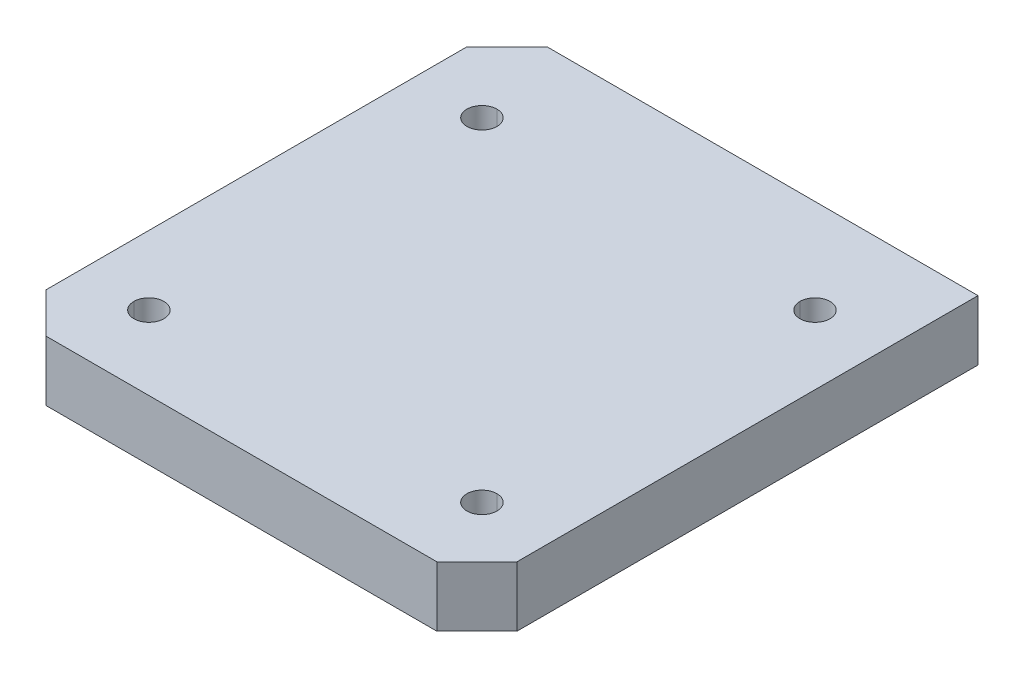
ISO-10303-21;
HEADER;
FILE_DESCRIPTION(('STEP AP214'),'2;1');
FILE_NAME('part.step','',(''),(''),'','','');
FILE_SCHEMA(('AUTOMOTIVE_DESIGN { 1 0 10303 214 1 1 1 1 }'));
ENDSEC;
DATA;
#1=APPLICATION_CONTEXT('core data for automotive mechanical design processes');
#2=APPLICATION_PROTOCOL_DEFINITION('international standard','automotive_design',2000,#1);
#3=PRODUCT_CONTEXT('',#1,'mechanical');
#4=PRODUCT('Part','Part','',(#3));
#5=PRODUCT_RELATED_PRODUCT_CATEGORY('part','',(#4));
#6=PRODUCT_DEFINITION_FORMATION('','',#4);
#7=PRODUCT_DEFINITION_CONTEXT('part definition',#1,'design');
#8=PRODUCT_DEFINITION('design','',#6,#7);
#9=PRODUCT_DEFINITION_SHAPE('','',#8);
#10=(LENGTH_UNIT() NAMED_UNIT(*) SI_UNIT(.MILLI.,.METRE.));
#11=(NAMED_UNIT(*) PLANE_ANGLE_UNIT() SI_UNIT($,.RADIAN.));
#12=(NAMED_UNIT(*) SI_UNIT($,.STERADIAN.) SOLID_ANGLE_UNIT());
#13=UNCERTAINTY_MEASURE_WITH_UNIT(LENGTH_MEASURE(1.E-05),#10,'distance_accuracy_value','');
#14=(GEOMETRIC_REPRESENTATION_CONTEXT(3) GLOBAL_UNCERTAINTY_ASSIGNED_CONTEXT((#13)) GLOBAL_UNIT_ASSIGNED_CONTEXT((#10,
#11,#12)) REPRESENTATION_CONTEXT('',''));
#15=CARTESIAN_POINT('',(0.,0.,0.));
#16=DIRECTION('',(0.,0.,1.));
#17=DIRECTION('',(1.,0.,0.));
#18=AXIS2_PLACEMENT_3D('',#15,#16,#17);
#19=CARTESIAN_POINT('',(0.,3.175,3.175));
#20=DIRECTION('',(0.,1.,0.));
#21=DIRECTION('',(0.,0.,1.));
#22=AXIS2_PLACEMENT_3D('',#19,#20,#21);
#23=PLANE('',#22);
#24=CARTESIAN_POINT('',(0.,3.175,3.175));
#25=DIRECTION('',(0.,-1.,0.));
#26=DIRECTION('',(0.,0.,-1.));
#27=AXIS2_PLACEMENT_3D('',#24,#25,#26);
#28=CIRCLE('',#27,57.15);
#29=CARTESIAN_POINT('',(57.15,3.175,3.175));
#30=VERTEX_POINT('',#29);
#31=CARTESIAN_POINT('',(-57.15,3.175,3.17499999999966));
#32=VERTEX_POINT('',#31);
#33=EDGE_CURVE('E19',#30,#32,#28,.T.);
#34=ORIENTED_EDGE('',*,*,#33,.T.);
#35=CARTESIAN_POINT('',(0.,3.175,3.175));
#36=DIRECTION('',(0.,-1.,0.));
#37=DIRECTION('',(0.,0.,-1.));
#38=AXIS2_PLACEMENT_3D('',#35,#36,#37);
#39=CIRCLE('',#38,57.15);
#40=EDGE_CURVE('E172',#32,#30,#39,.T.);
#41=ORIENTED_EDGE('',*,*,#40,.T.);
#42=EDGE_LOOP('',(#34,#41));
#43=FACE_BOUND('',#42,.T.);
#44=ADVANCED_FACE('F16',(#43),#23,.F.);
#45=CARTESIAN_POINT('',(-29.7687999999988,0.,-53.975));
#46=DIRECTION('',(0.,0.,1.));
#47=DIRECTION('',(1.,0.,0.));
#48=AXIS2_PLACEMENT_3D('',#45,#46,#47);
#49=PLANE('',#48);
#50=CARTESIAN_POINT('',(-29.7687999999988,0.,-53.975));
#51=DIRECTION('',(0.,0.,1.));
#52=DIRECTION('',(1.,0.,0.));
#53=AXIS2_PLACEMENT_3D('',#50,#51,#52);
#54=CIRCLE('',#53,3.96875);
#55=CARTESIAN_POINT('',(-25.8000499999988,0.,-53.975));
#56=VERTEX_POINT('',#55);
#57=CARTESIAN_POINT('',(-33.7375499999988,0.,-53.975));
#58=VERTEX_POINT('',#57);
#59=EDGE_CURVE('E276',#56,#58,#54,.F.);
#60=ORIENTED_EDGE('',*,*,#59,.T.);
#61=CARTESIAN_POINT('',(-29.7687999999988,0.,-53.975));
#62=DIRECTION('',(0.,0.,1.));
#63=DIRECTION('',(1.,0.,0.));
#64=AXIS2_PLACEMENT_3D('',#61,#62,#63);
#65=CIRCLE('',#64,3.96875);
#66=EDGE_CURVE('E280',#58,#56,#65,.F.);
#67=ORIENTED_EDGE('',*,*,#66,.T.);
#68=EDGE_LOOP('',(#60,#67));
#69=FACE_BOUND('',#68,.T.);
#70=ADVANCED_FACE('F395',(#69),#49,.F.);
#71=CARTESIAN_POINT('',(17.8561999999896,0.,-53.975));
#72=DIRECTION('',(0.,0.,1.));
#73=DIRECTION('',(1.,0.,0.));
#74=AXIS2_PLACEMENT_3D('',#71,#72,#73);
#75=PLANE('',#74);
#76=CARTESIAN_POINT('',(17.8561999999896,0.,-53.975));
#77=DIRECTION('',(0.,0.,1.));
#78=DIRECTION('',(1.,0.,0.));
#79=AXIS2_PLACEMENT_3D('',#76,#77,#78);
#80=CIRCLE('',#79,3.96875);
#81=CARTESIAN_POINT('',(21.8249499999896,0.,-53.975));
#82=VERTEX_POINT('',#81);
#83=CARTESIAN_POINT('',(13.8874499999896,0.,-53.975));
#84=VERTEX_POINT('',#83);
#85=EDGE_CURVE('E268',#82,#84,#80,.F.);
#86=ORIENTED_EDGE('',*,*,#85,.T.);
#87=CARTESIAN_POINT('',(17.8561999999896,0.,-53.975));
#88=DIRECTION('',(0.,0.,1.));
#89=DIRECTION('',(1.,0.,0.));
#90=AXIS2_PLACEMENT_3D('',#87,#88,#89);
#91=CIRCLE('',#90,3.96875);
#92=EDGE_CURVE('E272',#84,#82,#91,.F.);
#93=ORIENTED_EDGE('',*,*,#92,.T.);
#94=EDGE_LOOP('',(#86,#93));
#95=FACE_BOUND('',#94,.T.);
#96=ADVANCED_FACE('F397',(#95),#75,.F.);
#97=CARTESIAN_POINT('',(65.4812000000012,0.,-53.975));
#98=DIRECTION('',(0.,0.,1.));
#99=DIRECTION('',(1.,0.,0.));
#100=AXIS2_PLACEMENT_3D('',#97,#98,#99);
#101=PLANE('',#100);
#102=CARTESIAN_POINT('',(65.4812000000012,0.,-53.975));
#103=DIRECTION('',(0.,0.,1.));
#104=DIRECTION('',(1.,0.,0.));
#105=AXIS2_PLACEMENT_3D('',#102,#103,#104);
#106=CIRCLE('',#105,3.96875);
#107=CARTESIAN_POINT('',(69.4499500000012,0.,-53.975));
#108=VERTEX_POINT('',#107);
#109=CARTESIAN_POINT('',(61.5124500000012,0.,-53.975));
#110=VERTEX_POINT('',#109);
#111=EDGE_CURVE('E260',#108,#110,#106,.F.);
#112=ORIENTED_EDGE('',*,*,#111,.T.);
#113=CARTESIAN_POINT('',(65.4812000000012,0.,-53.975));
#114=DIRECTION('',(0.,0.,1.));
#115=DIRECTION('',(1.,0.,0.));
#116=AXIS2_PLACEMENT_3D('',#113,#114,#115);
#117=CIRCLE('',#116,3.96875);
#118=EDGE_CURVE('E264',#110,#108,#117,.F.);
#119=ORIENTED_EDGE('',*,*,#118,.T.);
#120=EDGE_LOOP('',(#112,#119));
#121=FACE_BOUND('',#120,.T.);
#122=ADVANCED_FACE('F402',(#121),#101,.F.);
#123=CARTESIAN_POINT('',(0.,-22.225,3.175));
#124=DIRECTION('',(0.,-1.,0.));
#125=DIRECTION('',(0.,0.,-1.));
#126=AXIS2_PLACEMENT_3D('',#123,#124,#125);
#127=CYLINDRICAL_SURFACE('',#126,57.15);
#128=CARTESIAN_POINT('',(0.,-9.525,3.175));
#129=DIRECTION('',(0.,-1.,0.));
#130=DIRECTION('',(0.,0.,-1.));
#131=AXIS2_PLACEMENT_3D('',#128,#129,#130);
#132=CIRCLE('',#131,57.15);
#133=CARTESIAN_POINT('',(-57.15,-9.525,3.1749999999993));
#134=VERTEX_POINT('',#133);
#135=CARTESIAN_POINT('',(57.15,-9.525,3.175));
#136=VERTEX_POINT('',#135);
#137=EDGE_CURVE('E181',#134,#136,#132,.F.);
#138=ORIENTED_EDGE('',*,*,#137,.F.);
#139=DIRECTION('',(0.,-1.,0.));
#140=VECTOR('',#139,1.);
#141=CARTESIAN_POINT('',(-57.15,-22.225,3.1749999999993));
#142=LINE('',#141,#140);
#143=EDGE_CURVE('E173',#134,#32,#142,.F.);
#144=ORIENTED_EDGE('',*,*,#143,.T.);
#145=ORIENTED_EDGE('',*,*,#33,.F.);
#146=DIRECTION('',(0.,-1.,0.));
#147=VECTOR('',#146,1.);
#148=CARTESIAN_POINT('',(57.15,-22.225,3.175));
#149=LINE('',#148,#147);
#150=EDGE_CURVE('E178',#30,#136,#149,.T.);
#151=ORIENTED_EDGE('',*,*,#150,.T.);
#152=EDGE_LOOP('',(#138,#144,#145,#151));
#153=FACE_BOUND('',#152,.T.);
#154=ADVANCED_FACE('F180',(#153),#127,.F.);
#155=CARTESIAN_POINT('',(0.,-22.225,3.175));
#156=DIRECTION('',(0.,-1.,0.));
#157=DIRECTION('',(0.,0.,-1.));
#158=AXIS2_PLACEMENT_3D('',#155,#156,#157);
#159=CYLINDRICAL_SURFACE('',#158,57.15);
#160=ORIENTED_EDGE('',*,*,#40,.F.);
#161=ORIENTED_EDGE('',*,*,#143,.F.);
#162=CARTESIAN_POINT('',(0.,-9.525,3.175));
#163=DIRECTION('',(0.,-1.,0.));
#164=DIRECTION('',(0.,0.,-1.));
#165=AXIS2_PLACEMENT_3D('',#162,#163,#164);
#166=CIRCLE('',#165,57.15);
#167=EDGE_CURVE('E256',#136,#134,#166,.F.);
#168=ORIENTED_EDGE('',*,*,#167,.F.);
#169=ORIENTED_EDGE('',*,*,#150,.F.);
#170=EDGE_LOOP('',(#160,#161,#168,#169));
#171=FACE_BOUND('',#170,.T.);
#172=ADVANCED_FACE('F175',(#171),#159,.F.);
#173=CARTESIAN_POINT('',(-29.7687999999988,0.,-66.675));
#174=DIRECTION('',(0.,0.,1.));
#175=DIRECTION('',(1.,0.,0.));
#176=AXIS2_PLACEMENT_3D('',#173,#174,#175);
#177=CYLINDRICAL_SURFACE('',#176,3.96875);
#178=ORIENTED_EDGE('',*,*,#66,.F.);
#179=DIRECTION('',(0.,0.,1.));
#180=VECTOR('',#179,1.);
#181=CARTESIAN_POINT('',(-33.7375499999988,0.,-66.675));
#182=LINE('',#181,#180);
#183=CARTESIAN_POINT('',(-33.7375499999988,0.,-79.375));
#184=VERTEX_POINT('',#183);
#185=EDGE_CURVE('E279',#58,#184,#182,.F.);
#186=ORIENTED_EDGE('',*,*,#185,.T.);
#187=CARTESIAN_POINT('',(-29.7687999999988,0.,-79.375));
#188=DIRECTION('',(0.,0.,1.));
#189=DIRECTION('',(1.,0.,0.));
#190=AXIS2_PLACEMENT_3D('',#187,#188,#189);
#191=CIRCLE('',#190,3.96875);
#192=CARTESIAN_POINT('',(-25.8000499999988,0.,-79.375));
#193=VERTEX_POINT('',#192);
#194=EDGE_CURVE('E225',#193,#184,#191,.T.);
#195=ORIENTED_EDGE('',*,*,#194,.F.);
#196=DIRECTION('',(0.,0.,1.));
#197=VECTOR('',#196,1.);
#198=CARTESIAN_POINT('',(-25.8000499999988,0.,-66.675));
#199=LINE('',#198,#197);
#200=EDGE_CURVE('E275',#193,#56,#199,.T.);
#201=ORIENTED_EDGE('',*,*,#200,.T.);
#202=EDGE_LOOP('',(#178,#186,#195,#201));
#203=FACE_BOUND('',#202,.T.);
#204=ADVANCED_FACE('F389',(#203),#177,.F.);
#205=CARTESIAN_POINT('',(-29.7687999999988,0.,-66.675));
#206=DIRECTION('',(0.,0.,1.));
#207=DIRECTION('',(1.,0.,0.));
#208=AXIS2_PLACEMENT_3D('',#205,#206,#207);
#209=CYLINDRICAL_SURFACE('',#208,3.96875);
#210=CARTESIAN_POINT('',(-29.7687999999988,0.,-79.375));
#211=DIRECTION('',(0.,0.,1.));
#212=DIRECTION('',(1.,0.,0.));
#213=AXIS2_PLACEMENT_3D('',#210,#211,#212);
#214=CIRCLE('',#213,3.96875);
#215=EDGE_CURVE('E222',#184,#193,#214,.T.);
#216=ORIENTED_EDGE('',*,*,#215,.F.);
#217=ORIENTED_EDGE('',*,*,#185,.F.);
#218=ORIENTED_EDGE('',*,*,#59,.F.);
#219=ORIENTED_EDGE('',*,*,#200,.F.);
#220=EDGE_LOOP('',(#216,#217,#218,#219));
#221=FACE_BOUND('',#220,.T.);
#222=ADVANCED_FACE('F393',(#221),#209,.F.);
#223=CARTESIAN_POINT('',(17.8561999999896,0.,-66.675));
#224=DIRECTION('',(0.,0.,1.));
#225=DIRECTION('',(1.,0.,0.));
#226=AXIS2_PLACEMENT_3D('',#223,#224,#225);
#227=CYLINDRICAL_SURFACE('',#226,3.96875);
#228=ORIENTED_EDGE('',*,*,#92,.F.);
#229=DIRECTION('',(0.,0.,1.));
#230=VECTOR('',#229,1.);
#231=CARTESIAN_POINT('',(13.8874499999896,0.,-66.675));
#232=LINE('',#231,#230);
#233=CARTESIAN_POINT('',(13.8874499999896,0.,-79.375));
#234=VERTEX_POINT('',#233);
#235=EDGE_CURVE('E271',#84,#234,#232,.F.);
#236=ORIENTED_EDGE('',*,*,#235,.T.);
#237=CARTESIAN_POINT('',(17.8561999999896,0.,-79.375));
#238=DIRECTION('',(0.,0.,1.));
#239=DIRECTION('',(1.,0.,0.));
#240=AXIS2_PLACEMENT_3D('',#237,#238,#239);
#241=CIRCLE('',#240,3.96875);
#242=CARTESIAN_POINT('',(21.8249499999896,0.,-79.375));
#243=VERTEX_POINT('',#242);
#244=EDGE_CURVE('E220',#243,#234,#241,.T.);
#245=ORIENTED_EDGE('',*,*,#244,.F.);
#246=DIRECTION('',(0.,0.,1.));
#247=VECTOR('',#246,1.);
#248=CARTESIAN_POINT('',(21.8249499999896,0.,-66.675));
#249=LINE('',#248,#247);
#250=EDGE_CURVE('E267',#243,#82,#249,.T.);
#251=ORIENTED_EDGE('',*,*,#250,.T.);
#252=EDGE_LOOP('',(#228,#236,#245,#251));
#253=FACE_BOUND('',#252,.T.);
#254=ADVANCED_FACE('F417',(#253),#227,.F.);
#255=CARTESIAN_POINT('',(17.8561999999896,0.,-66.675));
#256=DIRECTION('',(0.,0.,1.));
#257=DIRECTION('',(1.,0.,0.));
#258=AXIS2_PLACEMENT_3D('',#255,#256,#257);
#259=CYLINDRICAL_SURFACE('',#258,3.96875);
#260=CARTESIAN_POINT('',(17.8561999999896,0.,-79.375));
#261=DIRECTION('',(0.,0.,1.));
#262=DIRECTION('',(1.,0.,0.));
#263=AXIS2_PLACEMENT_3D('',#260,#261,#262);
#264=CIRCLE('',#263,3.96875);
#265=EDGE_CURVE('E217',#234,#243,#264,.T.);
#266=ORIENTED_EDGE('',*,*,#265,.F.);
#267=ORIENTED_EDGE('',*,*,#235,.F.);
#268=ORIENTED_EDGE('',*,*,#85,.F.);
#269=ORIENTED_EDGE('',*,*,#250,.F.);
#270=EDGE_LOOP('',(#266,#267,#268,#269));
#271=FACE_BOUND('',#270,.T.);
#272=ADVANCED_FACE('F420',(#271),#259,.F.);
#273=CARTESIAN_POINT('',(65.4812000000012,0.,-66.675));
#274=DIRECTION('',(0.,0.,1.));
#275=DIRECTION('',(1.,0.,0.));
#276=AXIS2_PLACEMENT_3D('',#273,#274,#275);
#277=CYLINDRICAL_SURFACE('',#276,3.96875);
#278=ORIENTED_EDGE('',*,*,#118,.F.);
#279=DIRECTION('',(0.,0.,1.));
#280=VECTOR('',#279,1.);
#281=CARTESIAN_POINT('',(61.5124500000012,0.,-66.675));
#282=LINE('',#281,#280);
#283=CARTESIAN_POINT('',(61.5124500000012,0.,-79.375));
#284=VERTEX_POINT('',#283);
#285=EDGE_CURVE('E263',#110,#284,#282,.F.);
#286=ORIENTED_EDGE('',*,*,#285,.T.);
#287=CARTESIAN_POINT('',(65.4812000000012,0.,-79.375));
#288=DIRECTION('',(0.,0.,1.));
#289=DIRECTION('',(1.,0.,0.));
#290=AXIS2_PLACEMENT_3D('',#287,#288,#289);
#291=CIRCLE('',#290,3.96875);
#292=CARTESIAN_POINT('',(69.4499500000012,0.,-79.375));
#293=VERTEX_POINT('',#292);
#294=EDGE_CURVE('E215',#293,#284,#291,.T.);
#295=ORIENTED_EDGE('',*,*,#294,.F.);
#296=DIRECTION('',(0.,0.,1.));
#297=VECTOR('',#296,1.);
#298=CARTESIAN_POINT('',(69.4499500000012,0.,-66.675));
#299=LINE('',#298,#297);
#300=EDGE_CURVE('E259',#293,#108,#299,.T.);
#301=ORIENTED_EDGE('',*,*,#300,.T.);
#302=EDGE_LOOP('',(#278,#286,#295,#301));
#303=FACE_BOUND('',#302,.T.);
#304=ADVANCED_FACE('F299',(#303),#277,.F.);
#305=CARTESIAN_POINT('',(65.4812000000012,0.,-66.675));
#306=DIRECTION('',(0.,0.,1.));
#307=DIRECTION('',(1.,0.,0.));
#308=AXIS2_PLACEMENT_3D('',#305,#306,#307);
#309=CYLINDRICAL_SURFACE('',#308,3.96875);
#310=CARTESIAN_POINT('',(65.4812000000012,0.,-79.375));
#311=DIRECTION('',(0.,0.,1.));
#312=DIRECTION('',(1.,0.,0.));
#313=AXIS2_PLACEMENT_3D('',#310,#311,#312);
#314=CIRCLE('',#313,3.96875);
#315=EDGE_CURVE('E211',#284,#293,#314,.T.);
#316=ORIENTED_EDGE('',*,*,#315,.F.);
#317=ORIENTED_EDGE('',*,*,#285,.F.);
#318=ORIENTED_EDGE('',*,*,#111,.F.);
#319=ORIENTED_EDGE('',*,*,#300,.F.);
#320=EDGE_LOOP('',(#316,#317,#318,#319));
#321=FACE_BOUND('',#320,.T.);
#322=ADVANCED_FACE('F288',(#321),#309,.F.);
#323=CARTESIAN_POINT('',(61.9125,-9.525,79.3750000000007));
#324=DIRECTION('',(0.,-1.,0.));
#325=DIRECTION('',(0.,0.,-1.));
#326=AXIS2_PLACEMENT_3D('',#323,#324,#325);
#327=PLANE('',#326);
#328=DIRECTION('',(-1.,0.,0.));
#329=VECTOR('',#328,1.);
#330=CARTESIAN_POINT('',(74.6125,-9.525,-79.375));
#331=LINE('',#330,#329);
#332=CARTESIAN_POINT('',(74.6125,-9.525,-79.3750000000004));
#333=VERTEX_POINT('',#332);
#334=CARTESIAN_POINT('',(-61.9125,-9.525,-79.3750000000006));
#335=VERTEX_POINT('',#334);
#336=EDGE_CURVE('E214',#333,#335,#331,.T.);
#337=ORIENTED_EDGE('',*,*,#336,.F.);
#338=DIRECTION('',(0.,0.,-1.));
#339=VECTOR('',#338,1.);
#340=CARTESIAN_POINT('',(74.6125,-9.525,66.6750000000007));
#341=LINE('',#340,#339);
#342=CARTESIAN_POINT('',(74.6125,-9.525,66.6750000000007));
#343=VERTEX_POINT('',#342);
#344=EDGE_CURVE('E572',#343,#333,#341,.T.);
#345=ORIENTED_EDGE('',*,*,#344,.F.);
#346=DIRECTION('',(0.707106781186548,0.,-0.707106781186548));
#347=VECTOR('',#346,1.);
#348=CARTESIAN_POINT('',(61.9125,-9.52500000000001,79.3750000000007));
#349=LINE('',#348,#347);
#350=CARTESIAN_POINT('',(61.9125,-9.525,79.3750000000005));
#351=VERTEX_POINT('',#350);
#352=EDGE_CURVE('E576',#351,#343,#349,.T.);
#353=ORIENTED_EDGE('',*,*,#352,.F.);
#354=DIRECTION('',(1.,0.,0.));
#355=VECTOR('',#354,1.);
#356=CARTESIAN_POINT('',(-61.9125,-9.525,79.375));
#357=LINE('',#356,#355);
#358=CARTESIAN_POINT('',(-61.9124999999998,-9.52500000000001,79.3750000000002));
#359=VERTEX_POINT('',#358);
#360=EDGE_CURVE('E583',#359,#351,#357,.T.);
#361=ORIENTED_EDGE('',*,*,#360,.F.);
#362=DIRECTION('',(0.707106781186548,0.,0.707106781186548));
#363=VECTOR('',#362,1.);
#364=CARTESIAN_POINT('',(-74.6125,-9.52500000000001,66.675));
#365=LINE('',#364,#363);
#366=CARTESIAN_POINT('',(-74.6125,-9.525,66.675));
#367=VERTEX_POINT('',#366);
#368=EDGE_CURVE('E560',#367,#359,#365,.T.);
#369=ORIENTED_EDGE('',*,*,#368,.F.);
#370=DIRECTION('',(0.,0.,1.));
#371=VECTOR('',#370,1.);
#372=CARTESIAN_POINT('',(-74.6125,-9.525,-66.6750000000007));
#373=LINE('',#372,#371);
#374=CARTESIAN_POINT('',(-74.6125,-9.525,-66.6750000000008));
#375=VERTEX_POINT('',#374);
#376=EDGE_CURVE('E562',#375,#367,#373,.T.);
#377=ORIENTED_EDGE('',*,*,#376,.F.);
#378=DIRECTION('',(-0.707106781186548,0.,0.707106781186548));
#379=VECTOR('',#378,1.);
#380=CARTESIAN_POINT('',(-61.9125,-9.52500000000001,-79.3750000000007));
#381=LINE('',#380,#379);
#382=EDGE_CURVE('E566',#335,#375,#381,.T.);
#383=ORIENTED_EDGE('',*,*,#382,.F.);
#384=EDGE_LOOP('',(#337,#345,#353,#361,#369,#377,#383));
#385=FACE_BOUND('',#384,.T.);
#386=CARTESIAN_POINT('',(-52.7590047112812,-9.525,-49.5840047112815));
#387=DIRECTION('',(0.,-1.,0.));
#388=DIRECTION('',(0.,0.,-1.));
#389=AXIS2_PLACEMENT_3D('',#386,#387,#388);
#390=CIRCLE('',#389,4.7625);
#391=CARTESIAN_POINT('',(-52.7590047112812,-9.525,-54.3465047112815));
#392=VERTEX_POINT('',#391);
#393=CARTESIAN_POINT('',(-52.7590047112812,-9.525,-44.8215047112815));
#394=VERTEX_POINT('',#393);
#395=EDGE_CURVE('E228',#392,#394,#390,.F.);
#396=ORIENTED_EDGE('',*,*,#395,.T.);
#397=CARTESIAN_POINT('',(-52.7590047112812,-9.525,-49.5840047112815));
#398=DIRECTION('',(0.,-1.,0.));
#399=DIRECTION('',(0.,0.,-1.));
#400=AXIS2_PLACEMENT_3D('',#397,#398,#399);
#401=CIRCLE('',#400,4.7625);
#402=EDGE_CURVE('E233',#394,#392,#401,.F.);
#403=ORIENTED_EDGE('',*,*,#402,.T.);
#404=EDGE_LOOP('',(#396,#403));
#405=FACE_BOUND('',#404,.T.);
#406=CARTESIAN_POINT('',(-52.7590047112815,-9.525,55.9340047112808));
#407=DIRECTION('',(0.,-1.,0.));
#408=DIRECTION('',(0.,0.,-1.));
#409=AXIS2_PLACEMENT_3D('',#406,#407,#408);
#410=CIRCLE('',#409,4.7625);
#411=CARTESIAN_POINT('',(-57.5215047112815,-9.525,55.9340047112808));
#412=VERTEX_POINT('',#411);
#413=CARTESIAN_POINT('',(-47.9965047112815,-9.525,55.9340047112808));
#414=VERTEX_POINT('',#413);
#415=EDGE_CURVE('E236',#412,#414,#410,.F.);
#416=ORIENTED_EDGE('',*,*,#415,.T.);
#417=CARTESIAN_POINT('',(-52.7590047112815,-9.525,55.9340047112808));
#418=DIRECTION('',(0.,-1.,0.));
#419=DIRECTION('',(0.,0.,-1.));
#420=AXIS2_PLACEMENT_3D('',#417,#418,#419);
#421=CIRCLE('',#420,4.7625);
#422=EDGE_CURVE('E240',#414,#412,#421,.F.);
#423=ORIENTED_EDGE('',*,*,#422,.T.);
#424=EDGE_LOOP('',(#416,#423));
#425=FACE_BOUND('',#424,.T.);
#426=CARTESIAN_POINT('',(52.7590047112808,-9.525,55.9340047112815));
#427=DIRECTION('',(0.,-1.,0.));
#428=DIRECTION('',(0.,0.,-1.));
#429=AXIS2_PLACEMENT_3D('',#426,#427,#428);
#430=CIRCLE('',#429,4.7625);
#431=CARTESIAN_POINT('',(52.7590047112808,-9.525,60.6965047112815));
#432=VERTEX_POINT('',#431);
#433=CARTESIAN_POINT('',(52.7590047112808,-9.525,51.1715047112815));
#434=VERTEX_POINT('',#433);
#435=EDGE_CURVE('E243',#432,#434,#430,.F.);
#436=ORIENTED_EDGE('',*,*,#435,.T.);
#437=CARTESIAN_POINT('',(52.7590047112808,-9.525,55.9340047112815));
#438=DIRECTION('',(0.,-1.,0.));
#439=DIRECTION('',(0.,0.,-1.));
#440=AXIS2_PLACEMENT_3D('',#437,#438,#439);
#441=CIRCLE('',#440,4.7625);
#442=EDGE_CURVE('E247',#434,#432,#441,.F.);
#443=ORIENTED_EDGE('',*,*,#442,.T.);
#444=EDGE_LOOP('',(#436,#443));
#445=FACE_BOUND('',#444,.T.);
#446=CARTESIAN_POINT('',(52.7590047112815,-9.525,-49.5840047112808));
#447=DIRECTION('',(0.,-1.,0.));
#448=DIRECTION('',(0.,0.,-1.));
#449=AXIS2_PLACEMENT_3D('',#446,#447,#448);
#450=CIRCLE('',#449,4.7625);
#451=CARTESIAN_POINT('',(57.5215047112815,-9.525,-49.5840047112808));
#452=VERTEX_POINT('',#451);
#453=CARTESIAN_POINT('',(47.9965047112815,-9.525,-49.5840047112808));
#454=VERTEX_POINT('',#453);
#455=EDGE_CURVE('E250',#452,#454,#450,.F.);
#456=ORIENTED_EDGE('',*,*,#455,.T.);
#457=CARTESIAN_POINT('',(52.7590047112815,-9.525,-49.5840047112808));
#458=DIRECTION('',(0.,-1.,0.));
#459=DIRECTION('',(0.,0.,-1.));
#460=AXIS2_PLACEMENT_3D('',#457,#458,#459);
#461=CIRCLE('',#460,4.7625);
#462=EDGE_CURVE('E254',#454,#452,#461,.F.);
#463=ORIENTED_EDGE('',*,*,#462,.T.);
#464=EDGE_LOOP('',(#456,#463));
#465=FACE_BOUND('',#464,.T.);
#466=ORIENTED_EDGE('',*,*,#137,.T.);
#467=ORIENTED_EDGE('',*,*,#167,.T.);
#468=EDGE_LOOP('',(#466,#467));
#469=FACE_BOUND('',#468,.T.);
#470=ADVANCED_FACE('F285',(#385,#405,#425,#445,#465,#469),#327,.T.);
#471=CARTESIAN_POINT('',(52.7590047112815,-19.05,-49.5840047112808));
#472=DIRECTION('',(0.,-1.,0.));
#473=DIRECTION('',(0.,0.,-1.));
#474=AXIS2_PLACEMENT_3D('',#471,#472,#473);
#475=CYLINDRICAL_SURFACE('',#474,4.7625);
#476=CARTESIAN_POINT('',(52.7590047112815,9.525,-49.5840047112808));
#477=DIRECTION('',(0.,-1.,0.));
#478=DIRECTION('',(0.,0.,-1.));
#479=AXIS2_PLACEMENT_3D('',#476,#477,#478);
#480=CIRCLE('',#479,4.7625);
#481=CARTESIAN_POINT('',(47.9965047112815,9.525,-49.5840047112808));
#482=VERTEX_POINT('',#481);
#483=CARTESIAN_POINT('',(57.5215047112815,9.525,-49.5840047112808));
#484=VERTEX_POINT('',#483);
#485=EDGE_CURVE('E208',#482,#484,#480,.F.);
#486=ORIENTED_EDGE('',*,*,#485,.T.);
#487=DIRECTION('',(0.,-1.,0.));
#488=VECTOR('',#487,1.);
#489=CARTESIAN_POINT('',(57.5215047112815,-19.05,-49.5840047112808));
#490=LINE('',#489,#488);
#491=EDGE_CURVE('E253',#484,#452,#490,.T.);
#492=ORIENTED_EDGE('',*,*,#491,.T.);
#493=ORIENTED_EDGE('',*,*,#462,.F.);
#494=DIRECTION('',(0.,-1.,0.));
#495=VECTOR('',#494,1.);
#496=CARTESIAN_POINT('',(47.9965047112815,-19.05,-49.5840047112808));
#497=LINE('',#496,#495);
#498=EDGE_CURVE('E249',#454,#482,#497,.F.);
#499=ORIENTED_EDGE('',*,*,#498,.T.);
#500=EDGE_LOOP('',(#486,#492,#493,#499));
#501=FACE_BOUND('',#500,.T.);
#502=ADVANCED_FACE('F287',(#501),#475,.F.);
#503=CARTESIAN_POINT('',(52.7590047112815,-19.05,-49.5840047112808));
#504=DIRECTION('',(0.,-1.,0.));
#505=DIRECTION('',(0.,0.,-1.));
#506=AXIS2_PLACEMENT_3D('',#503,#504,#505);
#507=CYLINDRICAL_SURFACE('',#506,4.7625);
#508=ORIENTED_EDGE('',*,*,#455,.F.);
#509=ORIENTED_EDGE('',*,*,#491,.F.);
#510=CARTESIAN_POINT('',(52.7590047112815,9.525,-49.5840047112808));
#511=DIRECTION('',(0.,-1.,0.));
#512=DIRECTION('',(0.,0.,-1.));
#513=AXIS2_PLACEMENT_3D('',#510,#511,#512);
#514=CIRCLE('',#513,4.7625);
#515=EDGE_CURVE('E205',#484,#482,#514,.F.);
#516=ORIENTED_EDGE('',*,*,#515,.T.);
#517=ORIENTED_EDGE('',*,*,#498,.F.);
#518=EDGE_LOOP('',(#508,#509,#516,#517));
#519=FACE_BOUND('',#518,.T.);
#520=ADVANCED_FACE('F296',(#519),#507,.F.);
#521=CARTESIAN_POINT('',(52.7590047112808,-19.05,55.9340047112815));
#522=DIRECTION('',(0.,-1.,0.));
#523=DIRECTION('',(0.,0.,-1.));
#524=AXIS2_PLACEMENT_3D('',#521,#522,#523);
#525=CYLINDRICAL_SURFACE('',#524,4.7625);
#526=CARTESIAN_POINT('',(52.7590047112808,9.525,55.9340047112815));
#527=DIRECTION('',(0.,-1.,0.));
#528=DIRECTION('',(0.,0.,-1.));
#529=AXIS2_PLACEMENT_3D('',#526,#527,#528);
#530=CIRCLE('',#529,4.7625);
#531=CARTESIAN_POINT('',(52.7590047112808,9.525,51.1715047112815));
#532=VERTEX_POINT('',#531);
#533=CARTESIAN_POINT('',(52.7590047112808,9.525,60.6965047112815));
#534=VERTEX_POINT('',#533);
#535=EDGE_CURVE('E202',#532,#534,#530,.F.);
#536=ORIENTED_EDGE('',*,*,#535,.T.);
#537=DIRECTION('',(0.,-1.,0.));
#538=VECTOR('',#537,1.);
#539=CARTESIAN_POINT('',(52.7590047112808,-19.05,60.6965047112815));
#540=LINE('',#539,#538);
#541=EDGE_CURVE('E246',#534,#432,#540,.T.);
#542=ORIENTED_EDGE('',*,*,#541,.T.);
#543=ORIENTED_EDGE('',*,*,#442,.F.);
#544=DIRECTION('',(0.,-1.,0.));
#545=VECTOR('',#544,1.);
#546=CARTESIAN_POINT('',(52.7590047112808,-19.05,51.1715047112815));
#547=LINE('',#546,#545);
#548=EDGE_CURVE('E242',#434,#532,#547,.F.);
#549=ORIENTED_EDGE('',*,*,#548,.T.);
#550=EDGE_LOOP('',(#536,#542,#543,#549));
#551=FACE_BOUND('',#550,.T.);
#552=ADVANCED_FACE('F359',(#551),#525,.F.);
#553=CARTESIAN_POINT('',(52.7590047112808,-19.05,55.9340047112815));
#554=DIRECTION('',(0.,-1.,0.));
#555=DIRECTION('',(0.,0.,-1.));
#556=AXIS2_PLACEMENT_3D('',#553,#554,#555);
#557=CYLINDRICAL_SURFACE('',#556,4.7625);
#558=ORIENTED_EDGE('',*,*,#435,.F.);
#559=ORIENTED_EDGE('',*,*,#541,.F.);
#560=CARTESIAN_POINT('',(52.7590047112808,9.525,55.9340047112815));
#561=DIRECTION('',(0.,-1.,0.));
#562=DIRECTION('',(0.,0.,-1.));
#563=AXIS2_PLACEMENT_3D('',#560,#561,#562);
#564=CIRCLE('',#563,4.7625);
#565=EDGE_CURVE('E199',#534,#532,#564,.F.);
#566=ORIENTED_EDGE('',*,*,#565,.T.);
#567=ORIENTED_EDGE('',*,*,#548,.F.);
#568=EDGE_LOOP('',(#558,#559,#566,#567));
#569=FACE_BOUND('',#568,.T.);
#570=ADVANCED_FACE('F355',(#569),#557,.F.);
#571=CARTESIAN_POINT('',(-52.7590047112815,-19.05,55.9340047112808));
#572=DIRECTION('',(0.,-1.,0.));
#573=DIRECTION('',(0.,0.,-1.));
#574=AXIS2_PLACEMENT_3D('',#571,#572,#573);
#575=CYLINDRICAL_SURFACE('',#574,4.7625);
#576=CARTESIAN_POINT('',(-52.7590047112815,9.525,55.9340047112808));
#577=DIRECTION('',(0.,-1.,0.));
#578=DIRECTION('',(0.,0.,-1.));
#579=AXIS2_PLACEMENT_3D('',#576,#577,#578);
#580=CIRCLE('',#579,4.7625);
#581=CARTESIAN_POINT('',(-47.9965047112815,9.525,55.9340047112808));
#582=VERTEX_POINT('',#581);
#583=CARTESIAN_POINT('',(-57.5215047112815,9.525,55.9340047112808));
#584=VERTEX_POINT('',#583);
#585=EDGE_CURVE('E196',#582,#584,#580,.F.);
#586=ORIENTED_EDGE('',*,*,#585,.T.);
#587=DIRECTION('',(0.,-1.,0.));
#588=VECTOR('',#587,1.);
#589=CARTESIAN_POINT('',(-57.5215047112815,-19.05,55.9340047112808));
#590=LINE('',#589,#588);
#591=EDGE_CURVE('E239',#584,#412,#590,.T.);
#592=ORIENTED_EDGE('',*,*,#591,.T.);
#593=ORIENTED_EDGE('',*,*,#422,.F.);
#594=DIRECTION('',(0.,-1.,0.));
#595=VECTOR('',#594,1.);
#596=CARTESIAN_POINT('',(-47.9965047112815,-19.05,55.9340047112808));
#597=LINE('',#596,#595);
#598=EDGE_CURVE('E235',#414,#582,#597,.F.);
#599=ORIENTED_EDGE('',*,*,#598,.T.);
#600=EDGE_LOOP('',(#586,#592,#593,#599));
#601=FACE_BOUND('',#600,.T.);
#602=ADVANCED_FACE('F351',(#601),#575,.F.);
#603=CARTESIAN_POINT('',(-52.7590047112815,-19.05,55.9340047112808));
#604=DIRECTION('',(0.,-1.,0.));
#605=DIRECTION('',(0.,0.,-1.));
#606=AXIS2_PLACEMENT_3D('',#603,#604,#605);
#607=CYLINDRICAL_SURFACE('',#606,4.7625);
#608=ORIENTED_EDGE('',*,*,#415,.F.);
#609=ORIENTED_EDGE('',*,*,#591,.F.);
#610=CARTESIAN_POINT('',(-52.7590047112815,9.525,55.9340047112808));
#611=DIRECTION('',(0.,-1.,0.));
#612=DIRECTION('',(0.,0.,-1.));
#613=AXIS2_PLACEMENT_3D('',#610,#611,#612);
#614=CIRCLE('',#613,4.7625);
#615=EDGE_CURVE('E193',#584,#582,#614,.F.);
#616=ORIENTED_EDGE('',*,*,#615,.T.);
#617=ORIENTED_EDGE('',*,*,#598,.F.);
#618=EDGE_LOOP('',(#608,#609,#616,#617));
#619=FACE_BOUND('',#618,.T.);
#620=ADVANCED_FACE('F347',(#619),#607,.F.);
#621=CARTESIAN_POINT('',(-52.7590047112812,-19.05,-49.5840047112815));
#622=DIRECTION('',(0.,-1.,0.));
#623=DIRECTION('',(0.,0.,-1.));
#624=AXIS2_PLACEMENT_3D('',#621,#622,#623);
#625=CYLINDRICAL_SURFACE('',#624,4.7625);
#626=CARTESIAN_POINT('',(-52.7590047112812,9.525,-49.5840047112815));
#627=DIRECTION('',(0.,-1.,0.));
#628=DIRECTION('',(0.,0.,-1.));
#629=AXIS2_PLACEMENT_3D('',#626,#627,#628);
#630=CIRCLE('',#629,4.7625);
#631=CARTESIAN_POINT('',(-52.7590047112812,9.525,-44.8215047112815));
#632=VERTEX_POINT('',#631);
#633=CARTESIAN_POINT('',(-52.7590047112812,9.525,-54.3465047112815));
#634=VERTEX_POINT('',#633);
#635=EDGE_CURVE('E190',#632,#634,#630,.F.);
#636=ORIENTED_EDGE('',*,*,#635,.T.);
#637=DIRECTION('',(0.,-1.,0.));
#638=VECTOR('',#637,1.);
#639=CARTESIAN_POINT('',(-52.7590047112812,-19.05,-54.3465047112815));
#640=LINE('',#639,#638);
#641=EDGE_CURVE('E232',#634,#392,#640,.T.);
#642=ORIENTED_EDGE('',*,*,#641,.T.);
#643=ORIENTED_EDGE('',*,*,#402,.F.);
#644=DIRECTION('',(0.,-1.,0.));
#645=VECTOR('',#644,1.);
#646=CARTESIAN_POINT('',(-52.7590047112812,-19.05,-44.8215047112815));
#647=LINE('',#646,#645);
#648=EDGE_CURVE('E231',#394,#632,#647,.F.);
#649=ORIENTED_EDGE('',*,*,#648,.T.);
#650=EDGE_LOOP('',(#636,#642,#643,#649));
#651=FACE_BOUND('',#650,.T.);
#652=ADVANCED_FACE('F343',(#651),#625,.F.);
#653=CARTESIAN_POINT('',(-52.7590047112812,-19.05,-49.5840047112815));
#654=DIRECTION('',(0.,-1.,0.));
#655=DIRECTION('',(0.,0.,-1.));
#656=AXIS2_PLACEMENT_3D('',#653,#654,#655);
#657=CYLINDRICAL_SURFACE('',#656,4.7625);
#658=ORIENTED_EDGE('',*,*,#395,.F.);
#659=ORIENTED_EDGE('',*,*,#641,.F.);
#660=CARTESIAN_POINT('',(-52.7590047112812,9.525,-49.5840047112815));
#661=DIRECTION('',(0.,-1.,0.));
#662=DIRECTION('',(0.,0.,-1.));
#663=AXIS2_PLACEMENT_3D('',#660,#661,#662);
#664=CIRCLE('',#663,4.7625);
#665=EDGE_CURVE('E186',#634,#632,#664,.F.);
#666=ORIENTED_EDGE('',*,*,#665,.T.);
#667=ORIENTED_EDGE('',*,*,#648,.F.);
#668=EDGE_LOOP('',(#658,#659,#666,#667));
#669=FACE_BOUND('',#668,.T.);
#670=ADVANCED_FACE('F339',(#669),#657,.F.);
#671=CARTESIAN_POINT('',(-74.6125,6.35,66.675));
#672=DIRECTION('',(-0.707106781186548,0.,0.707106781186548));
#673=DIRECTION('',(0.707106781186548,0.,0.707106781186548));
#674=AXIS2_PLACEMENT_3D('',#671,#672,#673);
#675=PLANE('',#674);
#676=DIRECTION('',(0.,-1.,0.));
#677=VECTOR('',#676,1.);
#678=CARTESIAN_POINT('',(-61.9125,6.35,79.375));
#679=LINE('',#678,#677);
#680=CARTESIAN_POINT('',(-61.9124999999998,9.525,79.3750000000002));
#681=VERTEX_POINT('',#680);
#682=EDGE_CURVE('E580',#681,#359,#679,.T.);
#683=ORIENTED_EDGE('',*,*,#682,.F.);
#684=DIRECTION('',(-0.707106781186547,0.,-0.707106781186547));
#685=VECTOR('',#684,1.);
#686=CARTESIAN_POINT('',(-61.9125,9.525,79.375));
#687=LINE('',#686,#685);
#688=CARTESIAN_POINT('',(-74.6125,9.525,66.675));
#689=VERTEX_POINT('',#688);
#690=EDGE_CURVE('E189',#681,#689,#687,.T.);
#691=ORIENTED_EDGE('',*,*,#690,.T.);
#692=DIRECTION('',(0.,1.,0.));
#693=VECTOR('',#692,1.);
#694=CARTESIAN_POINT('',(-74.6125,6.35,66.675));
#695=LINE('',#694,#693);
#696=EDGE_CURVE('E564',#367,#689,#695,.T.);
#697=ORIENTED_EDGE('',*,*,#696,.F.);
#698=ORIENTED_EDGE('',*,*,#368,.T.);
#699=EDGE_LOOP('',(#683,#691,#697,#698));
#700=FACE_BOUND('',#699,.T.);
#701=ADVANCED_FACE('F335',(#700),#675,.T.);
#702=CARTESIAN_POINT('',(-74.6125,6.35,-66.6750000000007));
#703=DIRECTION('',(-1.,0.,0.));
#704=DIRECTION('',(0.,0.,1.));
#705=AXIS2_PLACEMENT_3D('',#702,#703,#704);
#706=PLANE('',#705);
#707=ORIENTED_EDGE('',*,*,#696,.T.);
#708=DIRECTION('',(0.,0.,-1.));
#709=VECTOR('',#708,1.);
#710=CARTESIAN_POINT('',(-74.6125,9.525,9.52499999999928));
#711=LINE('',#710,#709);
#712=CARTESIAN_POINT('',(-74.6125,9.525,-66.6750000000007));
#713=VERTEX_POINT('',#712);
#714=EDGE_CURVE('E588',#689,#713,#711,.T.);
#715=ORIENTED_EDGE('',*,*,#714,.T.);
#716=DIRECTION('',(0.,1.,0.));
#717=VECTOR('',#716,1.);
#718=CARTESIAN_POINT('',(-74.6125,6.35,-66.6750000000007));
#719=LINE('',#718,#717);
#720=EDGE_CURVE('E227',#375,#713,#719,.T.);
#721=ORIENTED_EDGE('',*,*,#720,.F.);
#722=ORIENTED_EDGE('',*,*,#376,.T.);
#723=EDGE_LOOP('',(#707,#715,#721,#722));
#724=FACE_BOUND('',#723,.T.);
#725=ADVANCED_FACE('F331',(#724),#706,.T.);
#726=CARTESIAN_POINT('',(-61.9125,6.35,-79.3750000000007));
#727=DIRECTION('',(-0.707106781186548,0.,-0.707106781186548));
#728=DIRECTION('',(-0.707106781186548,0.,0.707106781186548));
#729=AXIS2_PLACEMENT_3D('',#726,#727,#728);
#730=PLANE('',#729);
#731=ORIENTED_EDGE('',*,*,#720,.T.);
#732=DIRECTION('',(0.707106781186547,0.,-0.707106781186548));
#733=VECTOR('',#732,1.);
#734=CARTESIAN_POINT('',(-74.6125,9.525,-66.6750000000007));
#735=LINE('',#734,#733);
#736=CARTESIAN_POINT('',(-61.9125,9.525,-79.3750000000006));
#737=VERTEX_POINT('',#736);
#738=EDGE_CURVE('E591',#713,#737,#735,.T.);
#739=ORIENTED_EDGE('',*,*,#738,.T.);
#740=DIRECTION('',(0.,1.,0.));
#741=VECTOR('',#740,1.);
#742=CARTESIAN_POINT('',(-61.9125,6.35,-79.3750000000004));
#743=LINE('',#742,#741);
#744=EDGE_CURVE('E570',#335,#737,#743,.T.);
#745=ORIENTED_EDGE('',*,*,#744,.F.);
#746=ORIENTED_EDGE('',*,*,#382,.T.);
#747=EDGE_LOOP('',(#731,#739,#745,#746));
#748=FACE_BOUND('',#747,.T.);
#749=ADVANCED_FACE('F327',(#748),#730,.T.);
#750=CARTESIAN_POINT('',(74.6125,6.35,-79.375));
#751=DIRECTION('',(0.,0.,-1.));
#752=DIRECTION('',(-1.,0.,0.));
#753=AXIS2_PLACEMENT_3D('',#750,#751,#752);
#754=PLANE('',#753);
#755=ORIENTED_EDGE('',*,*,#744,.T.);
#756=DIRECTION('',(1.,0.,0.));
#757=VECTOR('',#756,1.);
#758=CARTESIAN_POINT('',(-8.84464285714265,9.525,-79.3750000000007));
#759=LINE('',#758,#757);
#760=CARTESIAN_POINT('',(74.6125,9.525,-79.3750000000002));
#761=VERTEX_POINT('',#760);
#762=EDGE_CURVE('E594',#737,#761,#759,.T.);
#763=ORIENTED_EDGE('',*,*,#762,.T.);
#764=DIRECTION('',(0.,1.,0.));
#765=VECTOR('',#764,1.);
#766=CARTESIAN_POINT('',(74.6125,6.35,-79.375));
#767=LINE('',#766,#765);
#768=EDGE_CURVE('E574',#333,#761,#767,.T.);
#769=ORIENTED_EDGE('',*,*,#768,.F.);
#770=ORIENTED_EDGE('',*,*,#336,.T.);
#771=EDGE_LOOP('',(#755,#763,#769,#770));
#772=FACE_BOUND('',#771,.T.);
#773=ORIENTED_EDGE('',*,*,#294,.T.);
#774=ORIENTED_EDGE('',*,*,#315,.T.);
#775=EDGE_LOOP('',(#773,#774));
#776=FACE_BOUND('',#775,.T.);
#777=ORIENTED_EDGE('',*,*,#244,.T.);
#778=ORIENTED_EDGE('',*,*,#265,.T.);
#779=EDGE_LOOP('',(#777,#778));
#780=FACE_BOUND('',#779,.T.);
#781=ORIENTED_EDGE('',*,*,#194,.T.);
#782=ORIENTED_EDGE('',*,*,#215,.T.);
#783=EDGE_LOOP('',(#781,#782));
#784=FACE_BOUND('',#783,.T.);
#785=ADVANCED_FACE('F323',(#772,#776,#780,#784),#754,.T.);
#786=CARTESIAN_POINT('',(74.6125,6.35,66.6750000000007));
#787=DIRECTION('',(1.,0.,0.));
#788=DIRECTION('',(0.,0.,-1.));
#789=AXIS2_PLACEMENT_3D('',#786,#787,#788);
#790=PLANE('',#789);
#791=ORIENTED_EDGE('',*,*,#768,.T.);
#792=DIRECTION('',(0.,0.,-1.));
#793=VECTOR('',#792,1.);
#794=CARTESIAN_POINT('',(74.6125,9.525,9.52499999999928));
#795=LINE('',#794,#793);
#796=CARTESIAN_POINT('',(74.6125,9.525,66.6750000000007));
#797=VERTEX_POINT('',#796);
#798=EDGE_CURVE('E597',#761,#797,#795,.F.);
#799=ORIENTED_EDGE('',*,*,#798,.T.);
#800=DIRECTION('',(0.,1.,0.));
#801=VECTOR('',#800,1.);
#802=CARTESIAN_POINT('',(74.6125,6.35,66.6750000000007));
#803=LINE('',#802,#801);
#804=EDGE_CURVE('E578',#343,#797,#803,.T.);
#805=ORIENTED_EDGE('',*,*,#804,.F.);
#806=ORIENTED_EDGE('',*,*,#344,.T.);
#807=EDGE_LOOP('',(#791,#799,#805,#806));
#808=FACE_BOUND('',#807,.T.);
#809=ADVANCED_FACE('F319',(#808),#790,.T.);
#810=CARTESIAN_POINT('',(61.9125,6.35,79.3750000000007));
#811=DIRECTION('',(0.707106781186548,0.,0.707106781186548));
#812=DIRECTION('',(0.707106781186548,0.,-0.707106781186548));
#813=AXIS2_PLACEMENT_3D('',#810,#811,#812);
#814=PLANE('',#813);
#815=ORIENTED_EDGE('',*,*,#804,.T.);
#816=DIRECTION('',(-0.707106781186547,0.,0.707106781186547));
#817=VECTOR('',#816,1.);
#818=CARTESIAN_POINT('',(74.6125,9.525,66.6750000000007));
#819=LINE('',#818,#817);
#820=CARTESIAN_POINT('',(61.9125,9.525,79.3750000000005));
#821=VERTEX_POINT('',#820);
#822=EDGE_CURVE('E25',#797,#821,#819,.T.);
#823=ORIENTED_EDGE('',*,*,#822,.T.);
#824=DIRECTION('',(0.,-1.,0.));
#825=VECTOR('',#824,1.);
#826=CARTESIAN_POINT('',(61.9125,6.35,79.375));
#827=LINE('',#826,#825);
#828=EDGE_CURVE('E33',#351,#821,#827,.F.);
#829=ORIENTED_EDGE('',*,*,#828,.F.);
#830=ORIENTED_EDGE('',*,*,#352,.T.);
#831=EDGE_LOOP('',(#815,#823,#829,#830));
#832=FACE_BOUND('',#831,.T.);
#833=ADVANCED_FACE('F312',(#832),#814,.T.);
#834=CARTESIAN_POINT('',(-61.9125,6.35,79.375));
#835=DIRECTION('',(0.,0.,1.));
#836=DIRECTION('',(0.,-1.,0.));
#837=AXIS2_PLACEMENT_3D('',#834,#835,#836);
#838=PLANE('',#837);
#839=ORIENTED_EDGE('',*,*,#828,.T.);
#840=DIRECTION('',(1.,0.,0.));
#841=VECTOR('',#840,1.);
#842=CARTESIAN_POINT('',(-8.84464285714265,9.525,79.3750000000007));
#843=LINE('',#842,#841);
#844=EDGE_CURVE('E11',#821,#681,#843,.F.);
#845=ORIENTED_EDGE('',*,*,#844,.T.);
#846=ORIENTED_EDGE('',*,*,#682,.T.);
#847=ORIENTED_EDGE('',*,*,#360,.T.);
#848=EDGE_LOOP('',(#839,#845,#846,#847));
#849=FACE_BOUND('',#848,.T.);
#850=ADVANCED_FACE('F306',(#849),#838,.T.);
#851=CARTESIAN_POINT('',(-8.84464285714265,9.525,9.52499999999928));
#852=DIRECTION('',(0.,-1.,0.));
#853=DIRECTION('',(0.,0.,-1.));
#854=AXIS2_PLACEMENT_3D('',#851,#852,#853);
#855=PLANE('',#854);
#856=ORIENTED_EDGE('',*,*,#822,.F.);
#857=ORIENTED_EDGE('',*,*,#798,.F.);
#858=ORIENTED_EDGE('',*,*,#762,.F.);
#859=ORIENTED_EDGE('',*,*,#738,.F.);
#860=ORIENTED_EDGE('',*,*,#714,.F.);
#861=ORIENTED_EDGE('',*,*,#690,.F.);
#862=ORIENTED_EDGE('',*,*,#844,.F.);
#863=EDGE_LOOP('',(#856,#857,#858,#859,#860,#861,#862));
#864=FACE_BOUND('',#863,.T.);
#865=ORIENTED_EDGE('',*,*,#635,.F.);
#866=ORIENTED_EDGE('',*,*,#665,.F.);
#867=EDGE_LOOP('',(#865,#866));
#868=FACE_BOUND('',#867,.T.);
#869=ORIENTED_EDGE('',*,*,#585,.F.);
#870=ORIENTED_EDGE('',*,*,#615,.F.);
#871=EDGE_LOOP('',(#869,#870));
#872=FACE_BOUND('',#871,.T.);
#873=ORIENTED_EDGE('',*,*,#535,.F.);
#874=ORIENTED_EDGE('',*,*,#565,.F.);
#875=EDGE_LOOP('',(#873,#874));
#876=FACE_BOUND('',#875,.T.);
#877=ORIENTED_EDGE('',*,*,#485,.F.);
#878=ORIENTED_EDGE('',*,*,#515,.F.);
#879=EDGE_LOOP('',(#877,#878));
#880=FACE_BOUND('',#879,.T.);
#881=ADVANCED_FACE('F304',(#864,#868,#872,#876,#880),#855,.F.);
#882=CLOSED_SHELL('',(#44,#70,#96,#122,#154,#172,#204,#222,#254,#272,#304,#322,#470,#502,#520,
#552,#570,#602,#620,#652,#670,#701,#725,#749,#785,#809,#833,#850,#881));
#883=MANIFOLD_SOLID_BREP('B1',#882);
#884=ADVANCED_BREP_SHAPE_REPRESENTATION('',(#18,#883),#14);
#885=SHAPE_DEFINITION_REPRESENTATION(#9,#884);
ENDSEC;
END-ISO-10303-21;
